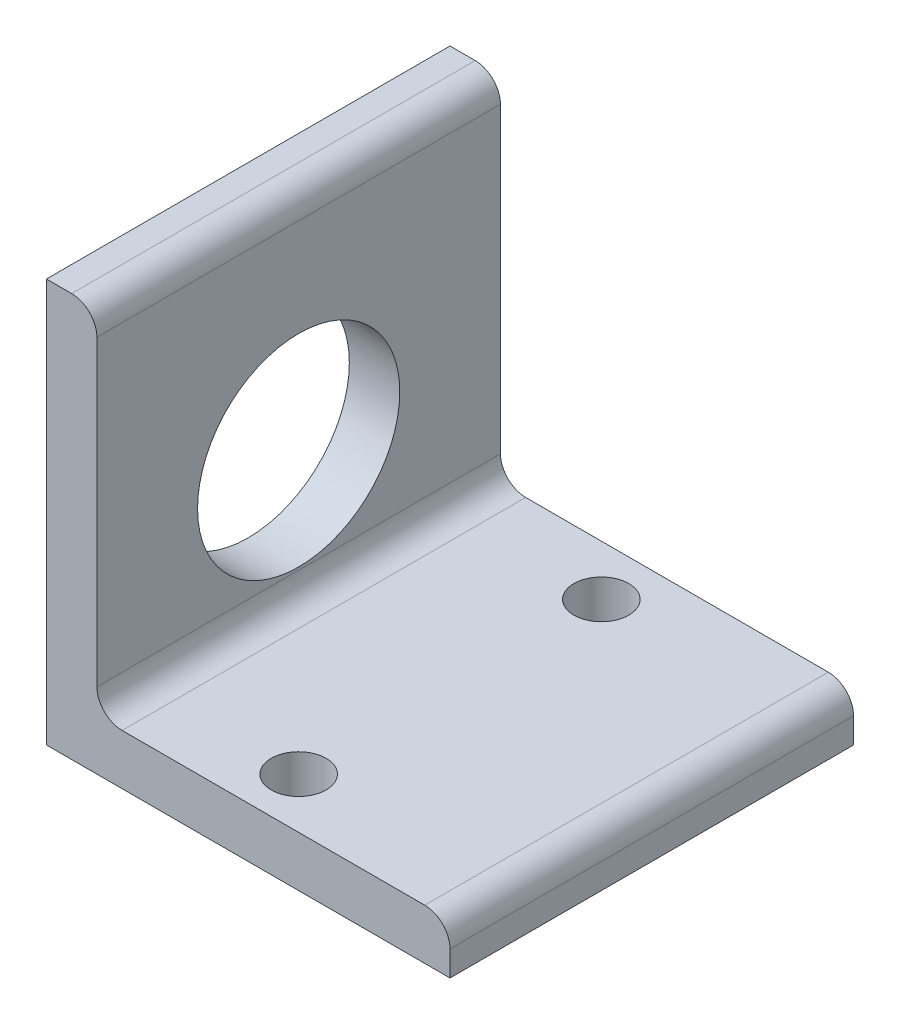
ISO-10303-21;
HEADER;
FILE_DESCRIPTION(('STEP AP214'),'2;1');
FILE_NAME('part.step','',(''),(''),'','','');
FILE_SCHEMA(('AUTOMOTIVE_DESIGN { 1 0 10303 214 1 1 1 1 }'));
ENDSEC;
DATA;
#1=APPLICATION_CONTEXT('core data for automotive mechanical design processes');
#2=APPLICATION_PROTOCOL_DEFINITION('international standard','automotive_design',2000,#1);
#3=PRODUCT_CONTEXT('',#1,'mechanical');
#4=PRODUCT('Part','Part','',(#3));
#5=PRODUCT_RELATED_PRODUCT_CATEGORY('part','',(#4));
#6=PRODUCT_DEFINITION_FORMATION('','',#4);
#7=PRODUCT_DEFINITION_CONTEXT('part definition',#1,'design');
#8=PRODUCT_DEFINITION('design','',#6,#7);
#9=PRODUCT_DEFINITION_SHAPE('','',#8);
#10=(LENGTH_UNIT() NAMED_UNIT(*) SI_UNIT(.MILLI.,.METRE.));
#11=(NAMED_UNIT(*) PLANE_ANGLE_UNIT() SI_UNIT($,.RADIAN.));
#12=(NAMED_UNIT(*) SI_UNIT($,.STERADIAN.) SOLID_ANGLE_UNIT());
#13=UNCERTAINTY_MEASURE_WITH_UNIT(LENGTH_MEASURE(1.E-05),#10,'distance_accuracy_value','');
#14=(GEOMETRIC_REPRESENTATION_CONTEXT(3) GLOBAL_UNCERTAINTY_ASSIGNED_CONTEXT((#13)) GLOBAL_UNIT_ASSIGNED_CONTEXT((#10,
#11,#12)) REPRESENTATION_CONTEXT('',''));
#15=CARTESIAN_POINT('',(0.,0.,0.));
#16=DIRECTION('',(0.,0.,1.));
#17=DIRECTION('',(1.,0.,0.));
#18=AXIS2_PLACEMENT_3D('',#15,#16,#17);
#19=CARTESIAN_POINT('',(25.4,0.,25.4));
#20=DIRECTION('',(1.,0.,0.));
#21=DIRECTION('',(0.,0.,-1.));
#22=AXIS2_PLACEMENT_3D('',#19,#20,#21);
#23=PLANE('',#22);
#24=DIRECTION('',(0.,-1.,0.));
#25=VECTOR('',#24,1.);
#26=CARTESIAN_POINT('',(25.4,0.,0.));
#27=LINE('',#26,#25);
#28=CARTESIAN_POINT('',(25.4,1.58749999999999,0.));
#29=VERTEX_POINT('',#28);
#30=CARTESIAN_POINT('',(25.4,0.,0.));
#31=VERTEX_POINT('',#30);
#32=EDGE_CURVE('E148',#29,#31,#27,.T.);
#33=ORIENTED_EDGE('',*,*,#32,.F.);
#34=DIRECTION('',(0.,0.,-1.));
#35=VECTOR('',#34,1.);
#36=CARTESIAN_POINT('',(25.4,1.58749999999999,25.4));
#37=LINE('',#36,#35);
#38=CARTESIAN_POINT('',(25.4,1.58749999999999,25.4));
#39=VERTEX_POINT('',#38);
#40=EDGE_CURVE('E187',#29,#39,#37,.F.);
#41=ORIENTED_EDGE('',*,*,#40,.T.);
#42=DIRECTION('',(0.,-1.,0.));
#43=VECTOR('',#42,1.);
#44=CARTESIAN_POINT('',(25.4,0.,25.4));
#45=LINE('',#44,#43);
#46=CARTESIAN_POINT('',(25.4,0.,25.4));
#47=VERTEX_POINT('',#46);
#48=EDGE_CURVE('E169',#39,#47,#45,.T.);
#49=ORIENTED_EDGE('',*,*,#48,.T.);
#50=DIRECTION('',(0.,0.,-1.));
#51=VECTOR('',#50,1.);
#52=CARTESIAN_POINT('',(25.4,0.,25.4));
#53=LINE('',#52,#51);
#54=EDGE_CURVE('E144',#47,#31,#53,.T.);
#55=ORIENTED_EDGE('',*,*,#54,.T.);
#56=EDGE_LOOP('',(#33,#41,#49,#55));
#57=FACE_BOUND('',#56,.T.);
#58=ADVANCED_FACE('F43',(#57),#23,.T.);
#59=CARTESIAN_POINT('',(0.,3.17499999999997,25.4));
#60=DIRECTION('',(0.,-1.,0.));
#61=DIRECTION('',(1.,0.,0.));
#62=AXIS2_PLACEMENT_3D('',#59,#60,#61);
#63=PLANE('',#62);
#64=CARTESIAN_POINT('',(12.7,3.17499999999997,22.225));
#65=DIRECTION('',(0.,1.,0.));
#66=DIRECTION('',(0.,0.,1.));
#67=AXIS2_PLACEMENT_3D('',#64,#65,#66);
#68=CIRCLE('',#67,1.7272);
#69=CARTESIAN_POINT('',(12.7,3.17499999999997,23.9522));
#70=VERTEX_POINT('',#69);
#71=EDGE_CURVE('E239',#70,#70,#68,.T.);
#72=ORIENTED_EDGE('',*,*,#71,.F.);
#73=EDGE_LOOP('',(#72));
#74=FACE_BOUND('',#73,.T.);
#75=CARTESIAN_POINT('',(12.7,3.17499999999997,3.175));
#76=DIRECTION('',(0.,1.,0.));
#77=DIRECTION('',(0.,0.,1.));
#78=AXIS2_PLACEMENT_3D('',#75,#76,#77);
#79=CIRCLE('',#78,1.7272);
#80=CARTESIAN_POINT('',(12.7,3.17499999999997,4.9022));
#81=VERTEX_POINT('',#80);
#82=EDGE_CURVE('E231',#81,#81,#79,.T.);
#83=ORIENTED_EDGE('',*,*,#82,.F.);
#84=EDGE_LOOP('',(#83));
#85=FACE_BOUND('',#84,.T.);
#86=DIRECTION('',(-1.,0.,0.));
#87=VECTOR('',#86,1.);
#88=CARTESIAN_POINT('',(0.,3.17499999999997,25.4));
#89=LINE('',#88,#87);
#90=CARTESIAN_POINT('',(23.8125,3.17499999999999,25.4));
#91=VERTEX_POINT('',#90);
#92=CARTESIAN_POINT('',(4.76249999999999,3.17499999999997,25.4));
#93=VERTEX_POINT('',#92);
#94=EDGE_CURVE('E221',#91,#93,#89,.T.);
#95=ORIENTED_EDGE('',*,*,#94,.F.);
#96=DIRECTION('',(0.,0.,-1.));
#97=VECTOR('',#96,1.);
#98=CARTESIAN_POINT('',(23.8125,3.17499999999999,0.));
#99=LINE('',#98,#97);
#100=CARTESIAN_POINT('',(23.8125,3.17499999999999,0.));
#101=VERTEX_POINT('',#100);
#102=EDGE_CURVE('E177',#91,#101,#99,.T.);
#103=ORIENTED_EDGE('',*,*,#102,.T.);
#104=DIRECTION('',(-1.,0.,0.));
#105=VECTOR('',#104,1.);
#106=CARTESIAN_POINT('',(0.,3.17499999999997,0.));
#107=LINE('',#106,#105);
#108=CARTESIAN_POINT('',(4.76249999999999,3.17499999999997,0.));
#109=VERTEX_POINT('',#108);
#110=EDGE_CURVE('E151',#101,#109,#107,.T.);
#111=ORIENTED_EDGE('',*,*,#110,.T.);
#112=DIRECTION('',(0.,0.,-1.));
#113=VECTOR('',#112,1.);
#114=CARTESIAN_POINT('',(4.76249999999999,3.17499999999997,25.4));
#115=LINE('',#114,#113);
#116=EDGE_CURVE('E126',#109,#93,#115,.F.);
#117=ORIENTED_EDGE('',*,*,#116,.T.);
#118=EDGE_LOOP('',(#95,#103,#111,#117));
#119=FACE_BOUND('',#118,.T.);
#120=ADVANCED_FACE('F215',(#74,#85,#119),#63,.F.);
#121=CARTESIAN_POINT('',(3.17499999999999,0.,25.4));
#122=DIRECTION('',(1.,0.,0.));
#123=DIRECTION('',(0.,1.,0.));
#124=AXIS2_PLACEMENT_3D('',#121,#122,#123);
#125=PLANE('',#124);
#126=CARTESIAN_POINT('',(3.17499999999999,11.303,12.7));
#127=DIRECTION('',(1.,0.,0.));
#128=DIRECTION('',(0.,1.,0.));
#129=AXIS2_PLACEMENT_3D('',#126,#127,#128);
#130=CIRCLE('',#129,6.3627);
#131=CARTESIAN_POINT('',(3.17499999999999,17.6657,12.7));
#132=VERTEX_POINT('',#131);
#133=EDGE_CURVE('E243',#132,#132,#130,.T.);
#134=ORIENTED_EDGE('',*,*,#133,.F.);
#135=EDGE_LOOP('',(#134));
#136=FACE_BOUND('',#135,.T.);
#137=DIRECTION('',(0.,-1.,0.));
#138=VECTOR('',#137,1.);
#139=CARTESIAN_POINT('',(3.17499999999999,0.,0.));
#140=LINE('',#139,#138);
#141=CARTESIAN_POINT('',(3.17499999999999,23.8125,0.));
#142=VERTEX_POINT('',#141);
#143=CARTESIAN_POINT('',(3.17499999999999,4.76249999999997,0.));
#144=VERTEX_POINT('',#143);
#145=EDGE_CURVE('E156',#142,#144,#140,.T.);
#146=ORIENTED_EDGE('',*,*,#145,.F.);
#147=DIRECTION('',(0.,0.,-1.));
#148=VECTOR('',#147,1.);
#149=CARTESIAN_POINT('',(3.17499999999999,23.8125,25.4));
#150=LINE('',#149,#148);
#151=CARTESIAN_POINT('',(3.17499999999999,23.8125,25.4));
#152=VERTEX_POINT('',#151);
#153=EDGE_CURVE('E202',#142,#152,#150,.F.);
#154=ORIENTED_EDGE('',*,*,#153,.T.);
#155=DIRECTION('',(0.,-1.,0.));
#156=VECTOR('',#155,1.);
#157=CARTESIAN_POINT('',(3.17499999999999,0.,25.4));
#158=LINE('',#157,#156);
#159=CARTESIAN_POINT('',(3.17499999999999,4.76249999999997,25.4));
#160=VERTEX_POINT('',#159);
#161=EDGE_CURVE('E135',#152,#160,#158,.T.);
#162=ORIENTED_EDGE('',*,*,#161,.T.);
#163=DIRECTION('',(0.,0.,-1.));
#164=VECTOR('',#163,1.);
#165=CARTESIAN_POINT('',(3.17499999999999,4.76249999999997,25.4));
#166=LINE('',#165,#164);
#167=EDGE_CURVE('E198',#160,#144,#166,.T.);
#168=ORIENTED_EDGE('',*,*,#167,.T.);
#169=EDGE_LOOP('',(#146,#154,#162,#168));
#170=FACE_BOUND('',#169,.T.);
#171=ADVANCED_FACE('F218',(#136,#170),#125,.T.);
#172=CARTESIAN_POINT('',(2.22044604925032E-13,25.4,25.4));
#173=DIRECTION('',(0.,1.,0.));
#174=DIRECTION('',(-1.,0.,0.));
#175=AXIS2_PLACEMENT_3D('',#172,#173,#174);
#176=PLANE('',#175);
#177=DIRECTION('',(1.,0.,0.));
#178=VECTOR('',#177,1.);
#179=CARTESIAN_POINT('',(2.22044604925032E-13,25.4,25.4));
#180=LINE('',#179,#178);
#181=CARTESIAN_POINT('',(0.,25.4,25.4));
#182=VERTEX_POINT('',#181);
#183=CARTESIAN_POINT('',(1.5875,25.4,25.4));
#184=VERTEX_POINT('',#183);
#185=EDGE_CURVE('E117',#182,#184,#180,.T.);
#186=ORIENTED_EDGE('',*,*,#185,.T.);
#187=DIRECTION('',(0.,0.,-1.));
#188=VECTOR('',#187,1.);
#189=CARTESIAN_POINT('',(1.5875,25.4,25.4));
#190=LINE('',#189,#188);
#191=CARTESIAN_POINT('',(1.5875,25.4,0.));
#192=VERTEX_POINT('',#191);
#193=EDGE_CURVE('E195',#184,#192,#190,.T.);
#194=ORIENTED_EDGE('',*,*,#193,.T.);
#195=DIRECTION('',(1.,0.,0.));
#196=VECTOR('',#195,1.);
#197=CARTESIAN_POINT('',(2.22044604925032E-13,25.4,0.));
#198=LINE('',#197,#196);
#199=CARTESIAN_POINT('',(0.,25.4,0.));
#200=VERTEX_POINT('',#199);
#201=EDGE_CURVE('E120',#200,#192,#198,.T.);
#202=ORIENTED_EDGE('',*,*,#201,.F.);
#203=DIRECTION('',(0.,0.,-1.));
#204=VECTOR('',#203,1.);
#205=CARTESIAN_POINT('',(0.,25.4,25.4));
#206=LINE('',#205,#204);
#207=EDGE_CURVE('E114',#182,#200,#206,.T.);
#208=ORIENTED_EDGE('',*,*,#207,.F.);
#209=EDGE_LOOP('',(#186,#194,#202,#208));
#210=FACE_BOUND('',#209,.T.);
#211=ADVANCED_FACE('F115',(#210),#176,.T.);
#212=CARTESIAN_POINT('',(0.,0.,25.4));
#213=DIRECTION('',(-1.,0.,0.));
#214=DIRECTION('',(0.,0.,1.));
#215=AXIS2_PLACEMENT_3D('',#212,#213,#214);
#216=PLANE('',#215);
#217=CARTESIAN_POINT('',(0.,11.303,12.7));
#218=DIRECTION('',(-1.,0.,0.));
#219=DIRECTION('',(0.,0.,1.));
#220=AXIS2_PLACEMENT_3D('',#217,#218,#219);
#221=CIRCLE('',#220,6.3627);
#222=CARTESIAN_POINT('',(0.,11.303,19.0627));
#223=VERTEX_POINT('',#222);
#224=EDGE_CURVE('E247',#223,#223,#221,.T.);
#225=ORIENTED_EDGE('',*,*,#224,.F.);
#226=EDGE_LOOP('',(#225));
#227=FACE_BOUND('',#226,.T.);
#228=DIRECTION('',(0.,1.,0.));
#229=VECTOR('',#228,1.);
#230=CARTESIAN_POINT('',(0.,0.,0.));
#231=LINE('',#230,#229);
#232=CARTESIAN_POINT('',(0.,0.,0.));
#233=VERTEX_POINT('',#232);
#234=EDGE_CURVE('E162',#233,#200,#231,.T.);
#235=ORIENTED_EDGE('',*,*,#234,.F.);
#236=DIRECTION('',(0.,0.,-1.));
#237=VECTOR('',#236,1.);
#238=CARTESIAN_POINT('',(0.,0.,25.4));
#239=LINE('',#238,#237);
#240=CARTESIAN_POINT('',(0.,0.,25.4));
#241=VERTEX_POINT('',#240);
#242=EDGE_CURVE('E127',#241,#233,#239,.T.);
#243=ORIENTED_EDGE('',*,*,#242,.F.);
#244=DIRECTION('',(0.,1.,0.));
#245=VECTOR('',#244,1.);
#246=CARTESIAN_POINT('',(0.,0.,25.4));
#247=LINE('',#246,#245);
#248=EDGE_CURVE('E133',#241,#182,#247,.T.);
#249=ORIENTED_EDGE('',*,*,#248,.T.);
#250=ORIENTED_EDGE('',*,*,#207,.T.);
#251=EDGE_LOOP('',(#235,#243,#249,#250));
#252=FACE_BOUND('',#251,.T.);
#253=ADVANCED_FACE('F137',(#227,#252),#216,.T.);
#254=CARTESIAN_POINT('',(0.,0.,25.4));
#255=DIRECTION('',(0.,1.,0.));
#256=DIRECTION('',(0.,0.,1.));
#257=AXIS2_PLACEMENT_3D('',#254,#255,#256);
#258=PLANE('',#257);
#259=CARTESIAN_POINT('',(12.7,0.,22.225));
#260=DIRECTION('',(0.,1.,0.));
#261=DIRECTION('',(0.,0.,1.));
#262=AXIS2_PLACEMENT_3D('',#259,#260,#261);
#263=CIRCLE('',#262,1.7272);
#264=CARTESIAN_POINT('',(12.7,0.,23.9522));
#265=VERTEX_POINT('',#264);
#266=EDGE_CURVE('E235',#265,#265,#263,.T.);
#267=ORIENTED_EDGE('',*,*,#266,.T.);
#268=EDGE_LOOP('',(#267));
#269=FACE_BOUND('',#268,.T.);
#270=CARTESIAN_POINT('',(12.7,0.,3.175));
#271=DIRECTION('',(0.,1.,0.));
#272=DIRECTION('',(0.,0.,1.));
#273=AXIS2_PLACEMENT_3D('',#270,#271,#272);
#274=CIRCLE('',#273,1.7272);
#275=CARTESIAN_POINT('',(12.7,0.,4.9022));
#276=VERTEX_POINT('',#275);
#277=EDGE_CURVE('E152',#276,#276,#274,.T.);
#278=ORIENTED_EDGE('',*,*,#277,.T.);
#279=EDGE_LOOP('',(#278));
#280=FACE_BOUND('',#279,.T.);
#281=DIRECTION('',(1.,0.,0.));
#282=VECTOR('',#281,1.);
#283=CARTESIAN_POINT('',(0.,0.,0.));
#284=LINE('',#283,#282);
#285=EDGE_CURVE('E165',#233,#31,#284,.T.);
#286=ORIENTED_EDGE('',*,*,#285,.T.);
#287=ORIENTED_EDGE('',*,*,#54,.F.);
#288=DIRECTION('',(1.,0.,0.));
#289=VECTOR('',#288,1.);
#290=CARTESIAN_POINT('',(0.,0.,25.4));
#291=LINE('',#290,#289);
#292=EDGE_CURVE('E140',#241,#47,#291,.T.);
#293=ORIENTED_EDGE('',*,*,#292,.F.);
#294=ORIENTED_EDGE('',*,*,#242,.T.);
#295=EDGE_LOOP('',(#286,#287,#293,#294));
#296=FACE_BOUND('',#295,.T.);
#297=ADVANCED_FACE('F256',(#269,#280,#296),#258,.F.);
#298=CARTESIAN_POINT('',(0.,0.,25.4));
#299=DIRECTION('',(0.,0.,1.));
#300=DIRECTION('',(1.,0.,0.));
#301=AXIS2_PLACEMENT_3D('',#298,#299,#300);
#302=PLANE('',#301);
#303=ORIENTED_EDGE('',*,*,#48,.F.);
#304=CARTESIAN_POINT('',(23.8125,1.58749999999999,25.4));
#305=DIRECTION('',(0.,0.,1.));
#306=DIRECTION('',(1.,0.,0.));
#307=AXIS2_PLACEMENT_3D('',#304,#305,#306);
#308=CIRCLE('',#307,1.5875);
#309=EDGE_CURVE('E192',#39,#91,#308,.T.);
#310=ORIENTED_EDGE('',*,*,#309,.T.);
#311=ORIENTED_EDGE('',*,*,#94,.T.);
#312=CARTESIAN_POINT('',(4.76249999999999,4.76249999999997,25.4));
#313=DIRECTION('',(0.,0.,1.));
#314=DIRECTION('',(1.,0.,0.));
#315=AXIS2_PLACEMENT_3D('',#312,#313,#314);
#316=CIRCLE('',#315,1.5875);
#317=EDGE_CURVE('E11',#93,#160,#316,.F.);
#318=ORIENTED_EDGE('',*,*,#317,.T.);
#319=ORIENTED_EDGE('',*,*,#161,.F.);
#320=CARTESIAN_POINT('',(1.58749999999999,23.8125,25.4));
#321=DIRECTION('',(0.,0.,1.));
#322=DIRECTION('',(1.,0.,0.));
#323=AXIS2_PLACEMENT_3D('',#320,#321,#322);
#324=CIRCLE('',#323,1.5875);
#325=EDGE_CURVE('E59',#152,#184,#324,.T.);
#326=ORIENTED_EDGE('',*,*,#325,.T.);
#327=ORIENTED_EDGE('',*,*,#185,.F.);
#328=ORIENTED_EDGE('',*,*,#248,.F.);
#329=ORIENTED_EDGE('',*,*,#292,.T.);
#330=EDGE_LOOP('',(#303,#310,#311,#318,#319,#326,#327,#328,#329));
#331=FACE_BOUND('',#330,.T.);
#332=ADVANCED_FACE('F131',(#331),#302,.T.);
#333=CARTESIAN_POINT('',(0.,0.,0.));
#334=DIRECTION('',(0.,0.,1.));
#335=DIRECTION('',(1.,0.,0.));
#336=AXIS2_PLACEMENT_3D('',#333,#334,#335);
#337=PLANE('',#336);
#338=ORIENTED_EDGE('',*,*,#110,.F.);
#339=CARTESIAN_POINT('',(23.8125,1.58749999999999,0.));
#340=DIRECTION('',(0.,0.,1.));
#341=DIRECTION('',(1.,0.,0.));
#342=AXIS2_PLACEMENT_3D('',#339,#340,#341);
#343=CIRCLE('',#342,1.5875);
#344=EDGE_CURVE('E184',#101,#29,#343,.F.);
#345=ORIENTED_EDGE('',*,*,#344,.T.);
#346=ORIENTED_EDGE('',*,*,#32,.T.);
#347=ORIENTED_EDGE('',*,*,#285,.F.);
#348=ORIENTED_EDGE('',*,*,#234,.T.);
#349=ORIENTED_EDGE('',*,*,#201,.T.);
#350=CARTESIAN_POINT('',(1.58749999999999,23.8125,0.));
#351=DIRECTION('',(0.,0.,1.));
#352=DIRECTION('',(1.,0.,0.));
#353=AXIS2_PLACEMENT_3D('',#350,#351,#352);
#354=CIRCLE('',#353,1.5875);
#355=EDGE_CURVE('E181',#192,#142,#354,.F.);
#356=ORIENTED_EDGE('',*,*,#355,.T.);
#357=ORIENTED_EDGE('',*,*,#145,.T.);
#358=CARTESIAN_POINT('',(4.76249999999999,4.76249999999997,0.));
#359=DIRECTION('',(0.,0.,1.));
#360=DIRECTION('',(1.,0.,0.));
#361=AXIS2_PLACEMENT_3D('',#358,#359,#360);
#362=CIRCLE('',#361,1.5875);
#363=EDGE_CURVE('E52',#144,#109,#362,.T.);
#364=ORIENTED_EDGE('',*,*,#363,.T.);
#365=EDGE_LOOP('',(#338,#345,#346,#347,#348,#349,#356,#357,#364));
#366=FACE_BOUND('',#365,.T.);
#367=ADVANCED_FACE('F208',(#366),#337,.F.);
#368=CARTESIAN_POINT('',(12.7,3.17499999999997,3.175));
#369=DIRECTION('',(0.,1.,0.));
#370=DIRECTION('',(0.,0.,1.));
#371=AXIS2_PLACEMENT_3D('',#368,#369,#370);
#372=CYLINDRICAL_SURFACE('',#371,1.7272);
#373=ORIENTED_EDGE('',*,*,#277,.F.);
#374=EDGE_LOOP('',(#373));
#375=FACE_BOUND('',#374,.T.);
#376=ORIENTED_EDGE('',*,*,#82,.T.);
#377=EDGE_LOOP('',(#376));
#378=FACE_BOUND('',#377,.T.);
#379=ADVANCED_FACE('F323',(#375,#378),#372,.F.);
#380=CARTESIAN_POINT('',(12.7,3.17499999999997,22.225));
#381=DIRECTION('',(0.,1.,0.));
#382=DIRECTION('',(0.,0.,1.));
#383=AXIS2_PLACEMENT_3D('',#380,#381,#382);
#384=CYLINDRICAL_SURFACE('',#383,1.7272);
#385=ORIENTED_EDGE('',*,*,#266,.F.);
#386=EDGE_LOOP('',(#385));
#387=FACE_BOUND('',#386,.T.);
#388=ORIENTED_EDGE('',*,*,#71,.T.);
#389=EDGE_LOOP('',(#388));
#390=FACE_BOUND('',#389,.T.);
#391=ADVANCED_FACE('F314',(#387,#390),#384,.F.);
#392=CARTESIAN_POINT('',(0.,11.303,12.7));
#393=DIRECTION('',(-1.,0.,0.));
#394=DIRECTION('',(0.,0.,1.));
#395=AXIS2_PLACEMENT_3D('',#392,#393,#394);
#396=CYLINDRICAL_SURFACE('',#395,6.3627);
#397=ORIENTED_EDGE('',*,*,#133,.T.);
#398=EDGE_LOOP('',(#397));
#399=FACE_BOUND('',#398,.T.);
#400=ORIENTED_EDGE('',*,*,#224,.T.);
#401=EDGE_LOOP('',(#400));
#402=FACE_BOUND('',#401,.T.);
#403=ADVANCED_FACE('F253',(#399,#402),#396,.F.);
#404=CARTESIAN_POINT('',(23.8125,1.58749999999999,25.4));
#405=DIRECTION('',(0.,0.,1.));
#406=DIRECTION('',(1.,0.,0.));
#407=AXIS2_PLACEMENT_3D('',#404,#405,#406);
#408=CYLINDRICAL_SURFACE('',#407,1.5875);
#409=ORIENTED_EDGE('',*,*,#309,.F.);
#410=ORIENTED_EDGE('',*,*,#40,.F.);
#411=ORIENTED_EDGE('',*,*,#344,.F.);
#412=ORIENTED_EDGE('',*,*,#102,.F.);
#413=EDGE_LOOP('',(#409,#410,#411,#412));
#414=FACE_BOUND('',#413,.T.);
#415=ADVANCED_FACE('F278',(#414),#408,.T.);
#416=CARTESIAN_POINT('',(1.58749999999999,23.8125,25.4));
#417=DIRECTION('',(0.,0.,-1.));
#418=DIRECTION('',(-1.,0.,0.));
#419=AXIS2_PLACEMENT_3D('',#416,#417,#418);
#420=CYLINDRICAL_SURFACE('',#419,1.5875);
#421=ORIENTED_EDGE('',*,*,#325,.F.);
#422=ORIENTED_EDGE('',*,*,#153,.F.);
#423=ORIENTED_EDGE('',*,*,#355,.F.);
#424=ORIENTED_EDGE('',*,*,#193,.F.);
#425=EDGE_LOOP('',(#421,#422,#423,#424));
#426=FACE_BOUND('',#425,.T.);
#427=ADVANCED_FACE('F280',(#426),#420,.T.);
#428=CARTESIAN_POINT('',(4.76249999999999,4.76249999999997,25.4));
#429=DIRECTION('',(0.,0.,-1.));
#430=DIRECTION('',(-1.,0.,0.));
#431=AXIS2_PLACEMENT_3D('',#428,#429,#430);
#432=CYLINDRICAL_SURFACE('',#431,1.5875);
#433=ORIENTED_EDGE('',*,*,#317,.F.);
#434=ORIENTED_EDGE('',*,*,#116,.F.);
#435=ORIENTED_EDGE('',*,*,#363,.F.);
#436=ORIENTED_EDGE('',*,*,#167,.F.);
#437=EDGE_LOOP('',(#433,#434,#435,#436));
#438=FACE_BOUND('',#437,.T.);
#439=ADVANCED_FACE('F45',(#438),#432,.F.);
#440=CLOSED_SHELL('',(#58,#120,#171,#211,#253,#297,#332,#367,#379,#391,#403,#415,#427,#439));
#441=MANIFOLD_SOLID_BREP('B2',#440);
#442=ADVANCED_BREP_SHAPE_REPRESENTATION('',(#18,#441),#14);
#443=SHAPE_DEFINITION_REPRESENTATION(#9,#442);
ENDSEC;
END-ISO-10303-21;
